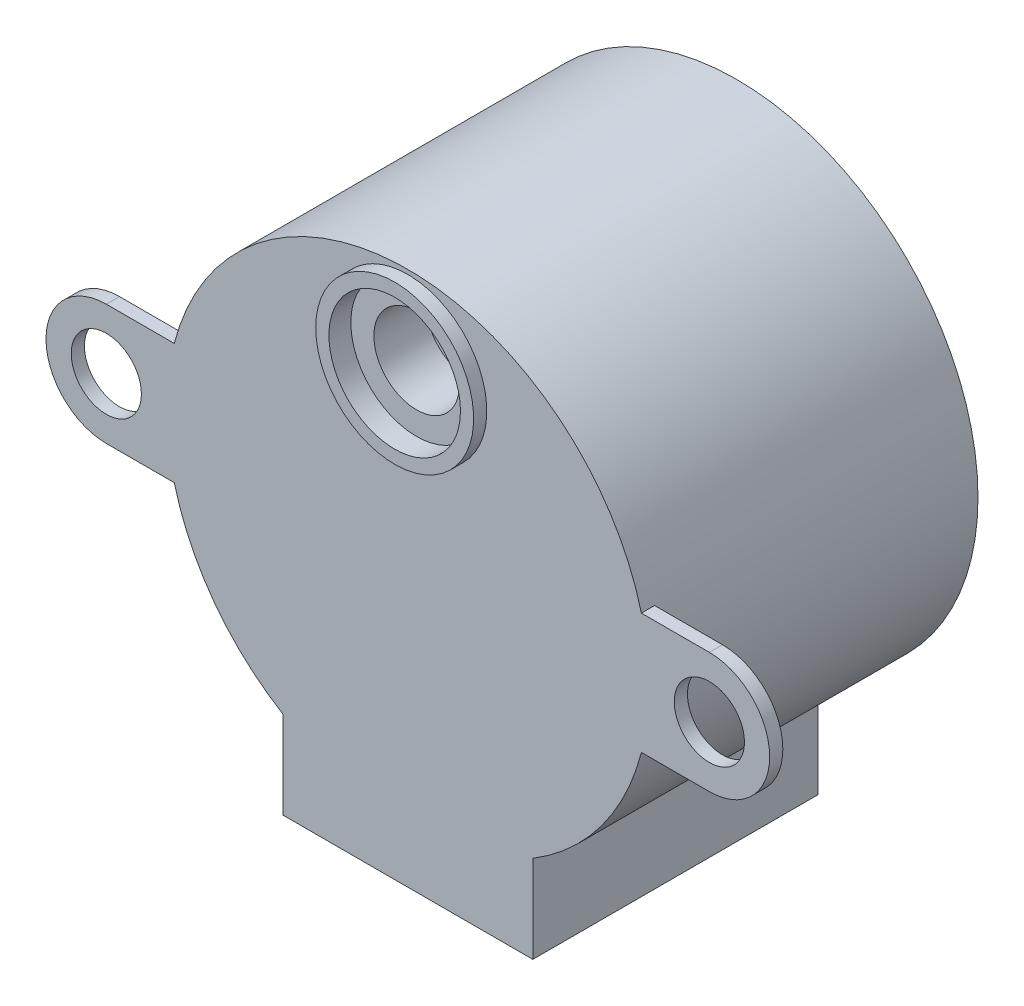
ISO-10303-21;
HEADER;
FILE_DESCRIPTION(('STEP AP214'),'2;1');
FILE_NAME('part.step','',(''),(''),'','','');
FILE_SCHEMA(('AUTOMOTIVE_DESIGN { 1 0 10303 214 1 1 1 1 }'));
ENDSEC;
DATA;
#1=APPLICATION_CONTEXT('core data for automotive mechanical design processes');
#2=APPLICATION_PROTOCOL_DEFINITION('international standard','automotive_design',2000,#1);
#3=PRODUCT_CONTEXT('',#1,'mechanical');
#4=PRODUCT('Part','Part','',(#3));
#5=PRODUCT_RELATED_PRODUCT_CATEGORY('part','',(#4));
#6=PRODUCT_DEFINITION_FORMATION('','',#4);
#7=PRODUCT_DEFINITION_CONTEXT('part definition',#1,'design');
#8=PRODUCT_DEFINITION('design','',#6,#7);
#9=PRODUCT_DEFINITION_SHAPE('','',#8);
#10=(LENGTH_UNIT() NAMED_UNIT(*) SI_UNIT(.MILLI.,.METRE.));
#11=(NAMED_UNIT(*) PLANE_ANGLE_UNIT() SI_UNIT($,.RADIAN.));
#12=(NAMED_UNIT(*) SI_UNIT($,.STERADIAN.) SOLID_ANGLE_UNIT());
#13=UNCERTAINTY_MEASURE_WITH_UNIT(LENGTH_MEASURE(1.E-05),#10,'distance_accuracy_value','');
#14=(GEOMETRIC_REPRESENTATION_CONTEXT(3) GLOBAL_UNCERTAINTY_ASSIGNED_CONTEXT((#13)) GLOBAL_UNIT_ASSIGNED_CONTEXT((#10,
#11,#12)) REPRESENTATION_CONTEXT('',''));
#15=CARTESIAN_POINT('',(0.,0.,0.));
#16=DIRECTION('',(0.,0.,1.));
#17=DIRECTION('',(1.,0.,0.));
#18=AXIS2_PLACEMENT_3D('',#15,#16,#17);
#19=CARTESIAN_POINT('',(0.,0.,19.05));
#20=DIRECTION('',(0.,0.,-1.));
#21=DIRECTION('',(-1.,0.,0.));
#22=AXIS2_PLACEMENT_3D('',#19,#20,#21);
#23=CYLINDRICAL_SURFACE('',#22,13.97);
#24=CARTESIAN_POINT('',(0.,0.,2.54));
#25=DIRECTION('',(0.,0.,1.));
#26=DIRECTION('',(1.,0.,0.));
#27=AXIS2_PLACEMENT_3D('',#24,#25,#26);
#28=CIRCLE('',#27,13.97);
#29=CARTESIAN_POINT('',(-7.239,-11.9481286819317,2.54));
#30=VERTEX_POINT('',#29);
#31=CARTESIAN_POINT('',(7.239,-11.9481286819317,2.54));
#32=VERTEX_POINT('',#31);
#33=EDGE_CURVE('E11',#30,#32,#28,.T.);
#34=ORIENTED_EDGE('',*,*,#33,.F.);
#35=DIRECTION('',(0.,0.,-1.));
#36=VECTOR('',#35,1.);
#37=CARTESIAN_POINT('',(-7.239,-11.9481286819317,19.05));
#38=LINE('',#37,#36);
#39=CARTESIAN_POINT('',(-7.239,-11.9481286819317,19.05));
#40=VERTEX_POINT('',#39);
#41=EDGE_CURVE('E128',#30,#40,#38,.F.);
#42=ORIENTED_EDGE('',*,*,#41,.T.);
#43=CARTESIAN_POINT('',(0.,0.,19.05));
#44=DIRECTION('',(0.,0.,1.));
#45=DIRECTION('',(1.,0.,0.));
#46=AXIS2_PLACEMENT_3D('',#43,#44,#45);
#47=CIRCLE('',#46,13.97);
#48=CARTESIAN_POINT('',(-13.5263943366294,-3.49250000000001,19.05));
#49=VERTEX_POINT('',#48);
#50=EDGE_CURVE('E223',#49,#40,#47,.T.);
#51=ORIENTED_EDGE('',*,*,#50,.F.);
#52=DIRECTION('',(0.,0.,-1.));
#53=VECTOR('',#52,1.);
#54=CARTESIAN_POINT('',(-13.5263943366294,-3.4925,19.05));
#55=LINE('',#54,#53);
#56=CARTESIAN_POINT('',(-13.5263943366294,-3.49250000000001,18.288));
#57=VERTEX_POINT('',#56);
#58=EDGE_CURVE('E215',#49,#57,#55,.T.);
#59=ORIENTED_EDGE('',*,*,#58,.T.);
#60=CARTESIAN_POINT('',(0.,0.,18.288));
#61=DIRECTION('',(0.,0.,1.));
#62=DIRECTION('',(1.,0.,0.));
#63=AXIS2_PLACEMENT_3D('',#60,#61,#62);
#64=CIRCLE('',#63,13.97);
#65=CARTESIAN_POINT('',(-13.5263943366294,3.4925,18.288));
#66=VERTEX_POINT('',#65);
#67=EDGE_CURVE('E40',#66,#57,#64,.T.);
#68=ORIENTED_EDGE('',*,*,#67,.F.);
#69=DIRECTION('',(0.,0.,-1.));
#70=VECTOR('',#69,1.);
#71=CARTESIAN_POINT('',(-13.5263943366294,3.4925,19.05));
#72=LINE('',#71,#70);
#73=CARTESIAN_POINT('',(-13.5263943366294,3.4925,19.05));
#74=VERTEX_POINT('',#73);
#75=EDGE_CURVE('E200',#66,#74,#72,.F.);
#76=ORIENTED_EDGE('',*,*,#75,.T.);
#77=CARTESIAN_POINT('',(13.5263943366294,3.4925,19.05));
#78=VERTEX_POINT('',#77);
#79=EDGE_CURVE('E219',#78,#74,#47,.T.);
#80=ORIENTED_EDGE('',*,*,#79,.F.);
#81=DIRECTION('',(0.,0.,-1.));
#82=VECTOR('',#81,1.);
#83=CARTESIAN_POINT('',(13.5263943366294,3.4925,19.05));
#84=LINE('',#83,#82);
#85=CARTESIAN_POINT('',(13.5263943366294,3.4925,18.288));
#86=VERTEX_POINT('',#85);
#87=EDGE_CURVE('E209',#78,#86,#84,.T.);
#88=ORIENTED_EDGE('',*,*,#87,.T.);
#89=CARTESIAN_POINT('',(13.5263943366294,-3.4925,18.288));
#90=VERTEX_POINT('',#89);
#91=EDGE_CURVE('E222',#90,#86,#64,.T.);
#92=ORIENTED_EDGE('',*,*,#91,.F.);
#93=DIRECTION('',(0.,0.,-1.));
#94=VECTOR('',#93,1.);
#95=CARTESIAN_POINT('',(13.5263943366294,-3.4925,19.05));
#96=LINE('',#95,#94);
#97=CARTESIAN_POINT('',(13.5263943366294,-3.4925,19.05));
#98=VERTEX_POINT('',#97);
#99=EDGE_CURVE('E212',#90,#98,#96,.F.);
#100=ORIENTED_EDGE('',*,*,#99,.T.);
#101=CARTESIAN_POINT('',(7.239,-11.9481286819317,19.05));
#102=VERTEX_POINT('',#101);
#103=EDGE_CURVE('E224',#102,#98,#47,.T.);
#104=ORIENTED_EDGE('',*,*,#103,.F.);
#105=DIRECTION('',(0.,0.,-1.));
#106=VECTOR('',#105,1.);
#107=CARTESIAN_POINT('',(7.239,-11.9481286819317,19.05));
#108=LINE('',#107,#106);
#109=EDGE_CURVE('E153',#102,#32,#108,.T.);
#110=ORIENTED_EDGE('',*,*,#109,.T.);
#111=EDGE_LOOP('',(#34,#42,#51,#59,#68,#76,#80,#88,#92,#100,#104,#110));
#112=FACE_BOUND('',#111,.T.);
#113=CARTESIAN_POINT('',(0.,0.,0.));
#114=DIRECTION('',(0.,0.,1.));
#115=DIRECTION('',(1.,0.,0.));
#116=AXIS2_PLACEMENT_3D('',#113,#114,#115);
#117=CIRCLE('',#116,13.97);
#118=CARTESIAN_POINT('',(13.97,0.,0.));
#119=VERTEX_POINT('',#118);
#120=EDGE_CURVE('E218',#119,#119,#117,.T.);
#121=ORIENTED_EDGE('',*,*,#120,.T.);
#122=EDGE_LOOP('',(#121));
#123=FACE_BOUND('',#122,.T.);
#124=ADVANCED_FACE('F33',(#112,#123),#23,.T.);
#125=CARTESIAN_POINT('',(0.,0.,19.05));
#126=DIRECTION('',(0.,0.,1.));
#127=DIRECTION('',(1.,0.,0.));
#128=AXIS2_PLACEMENT_3D('',#125,#126,#127);
#129=PLANE('',#128);
#130=ORIENTED_EDGE('',*,*,#50,.T.);
#131=DIRECTION('',(0.,-1.,0.));
#132=VECTOR('',#131,1.);
#133=CARTESIAN_POINT('',(-7.239,-11.8025654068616,19.05));
#134=LINE('',#133,#132);
#135=CARTESIAN_POINT('',(-7.239,-17.018,19.05));
#136=VERTEX_POINT('',#135);
#137=EDGE_CURVE('E148',#40,#136,#134,.T.);
#138=ORIENTED_EDGE('',*,*,#137,.T.);
#139=DIRECTION('',(1.,0.,0.));
#140=VECTOR('',#139,1.);
#141=CARTESIAN_POINT('',(-7.239,-17.018,19.05));
#142=LINE('',#141,#140);
#143=CARTESIAN_POINT('',(7.239,-17.018,19.05));
#144=VERTEX_POINT('',#143);
#145=EDGE_CURVE('E137',#136,#144,#142,.T.);
#146=ORIENTED_EDGE('',*,*,#145,.T.);
#147=DIRECTION('',(0.,1.,0.));
#148=VECTOR('',#147,1.);
#149=CARTESIAN_POINT('',(7.239,-11.8025654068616,19.05));
#150=LINE('',#149,#148);
#151=EDGE_CURVE('E47',#144,#102,#150,.T.);
#152=ORIENTED_EDGE('',*,*,#151,.T.);
#153=ORIENTED_EDGE('',*,*,#103,.T.);
#154=DIRECTION('',(1.,0.,0.));
#155=VECTOR('',#154,1.);
#156=CARTESIAN_POINT('',(17.4625,-3.4925,19.05));
#157=LINE('',#156,#155);
#158=CARTESIAN_POINT('',(17.4625,-3.4925,19.05));
#159=VERTEX_POINT('',#158);
#160=EDGE_CURVE('E195',#98,#159,#157,.T.);
#161=ORIENTED_EDGE('',*,*,#160,.T.);
#162=CARTESIAN_POINT('',(17.4625,0.,19.05));
#163=DIRECTION('',(0.,0.,1.));
#164=DIRECTION('',(1.,0.,0.));
#165=AXIS2_PLACEMENT_3D('',#162,#163,#164);
#166=CIRCLE('',#165,3.4925);
#167=CARTESIAN_POINT('',(17.4625,3.4925,19.05));
#168=VERTEX_POINT('',#167);
#169=EDGE_CURVE('E186',#159,#168,#166,.T.);
#170=ORIENTED_EDGE('',*,*,#169,.T.);
#171=DIRECTION('',(-1.,0.,0.));
#172=VECTOR('',#171,1.);
#173=CARTESIAN_POINT('',(17.4625,3.4925,19.05));
#174=LINE('',#173,#172);
#175=EDGE_CURVE('E191',#168,#78,#174,.T.);
#176=ORIENTED_EDGE('',*,*,#175,.T.);
#177=ORIENTED_EDGE('',*,*,#79,.T.);
#178=CARTESIAN_POINT('',(-17.4625,3.4925,19.05));
#179=VERTEX_POINT('',#178);
#180=EDGE_CURVE('E189',#74,#179,#174,.T.);
#181=ORIENTED_EDGE('',*,*,#180,.T.);
#182=CARTESIAN_POINT('',(-17.4625,0.,19.05));
#183=DIRECTION('',(0.,0.,1.));
#184=DIRECTION('',(1.,0.,0.));
#185=AXIS2_PLACEMENT_3D('',#182,#183,#184);
#186=CIRCLE('',#185,3.4925);
#187=CARTESIAN_POINT('',(-17.4625,-3.49250000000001,19.05));
#188=VERTEX_POINT('',#187);
#189=EDGE_CURVE('E193',#179,#188,#186,.T.);
#190=ORIENTED_EDGE('',*,*,#189,.T.);
#191=EDGE_CURVE('E54',#188,#49,#157,.T.);
#192=ORIENTED_EDGE('',*,*,#191,.T.);
#193=EDGE_LOOP('',(#130,#138,#146,#152,#153,#161,#170,#176,#177,#181,#190,#192));
#194=FACE_BOUND('',#193,.T.);
#195=CARTESIAN_POINT('',(0.,9.144,19.05));
#196=DIRECTION('',(0.,0.,1.));
#197=DIRECTION('',(1.,0.,0.));
#198=AXIS2_PLACEMENT_3D('',#195,#196,#197);
#199=CIRCLE('',#198,4.572);
#200=CARTESIAN_POINT('',(-4.572,9.144,19.05));
#201=VERTEX_POINT('',#200);
#202=EDGE_CURVE('E158',#201,#201,#199,.T.);
#203=ORIENTED_EDGE('',*,*,#202,.F.);
#204=EDGE_LOOP('',(#203));
#205=FACE_BOUND('',#204,.T.);
#206=CARTESIAN_POINT('',(-17.4625,0.,19.05));
#207=DIRECTION('',(0.,0.,1.));
#208=DIRECTION('',(1.,0.,0.));
#209=AXIS2_PLACEMENT_3D('',#206,#207,#208);
#210=CIRCLE('',#209,2.032);
#211=CARTESIAN_POINT('',(-15.4305,0.,19.05));
#212=VERTEX_POINT('',#211);
#213=EDGE_CURVE('E165',#212,#212,#210,.T.);
#214=ORIENTED_EDGE('',*,*,#213,.F.);
#215=EDGE_LOOP('',(#214));
#216=FACE_BOUND('',#215,.T.);
#217=CARTESIAN_POINT('',(17.4625,0.,19.05));
#218=DIRECTION('',(0.,0.,1.));
#219=DIRECTION('',(1.,0.,0.));
#220=AXIS2_PLACEMENT_3D('',#217,#218,#219);
#221=CIRCLE('',#220,2.032);
#222=CARTESIAN_POINT('',(19.4945,0.,19.05));
#223=VERTEX_POINT('',#222);
#224=EDGE_CURVE('E162',#223,#223,#221,.T.);
#225=ORIENTED_EDGE('',*,*,#224,.F.);
#226=EDGE_LOOP('',(#225));
#227=FACE_BOUND('',#226,.T.);
#228=ADVANCED_FACE('F253',(#194,#205,#216,#227),#129,.T.);
#229=CARTESIAN_POINT('',(0.,0.,0.));
#230=DIRECTION('',(0.,0.,1.));
#231=DIRECTION('',(1.,0.,0.));
#232=AXIS2_PLACEMENT_3D('',#229,#230,#231);
#233=PLANE('',#232);
#234=ORIENTED_EDGE('',*,*,#120,.F.);
#235=EDGE_LOOP('',(#234));
#236=FACE_BOUND('',#235,.T.);
#237=ADVANCED_FACE('F258',(#236),#233,.F.);
#238=CARTESIAN_POINT('',(17.4625,0.,18.288));
#239=DIRECTION('',(0.,0.,1.));
#240=DIRECTION('',(1.,0.,0.));
#241=AXIS2_PLACEMENT_3D('',#238,#239,#240);
#242=CYLINDRICAL_SURFACE('',#241,3.4925);
#243=ORIENTED_EDGE('',*,*,#169,.F.);
#244=DIRECTION('',(0.,0.,1.));
#245=VECTOR('',#244,1.);
#246=CARTESIAN_POINT('',(17.4625,-3.4925,18.288));
#247=LINE('',#246,#245);
#248=CARTESIAN_POINT('',(17.4625,-3.4925,18.288));
#249=VERTEX_POINT('',#248);
#250=EDGE_CURVE('E197',#249,#159,#247,.T.);
#251=ORIENTED_EDGE('',*,*,#250,.F.);
#252=CARTESIAN_POINT('',(17.4625,0.,18.288));
#253=DIRECTION('',(0.,0.,1.));
#254=DIRECTION('',(1.,0.,0.));
#255=AXIS2_PLACEMENT_3D('',#252,#253,#254);
#256=CIRCLE('',#255,3.4925);
#257=CARTESIAN_POINT('',(17.4625,3.4925,18.288));
#258=VERTEX_POINT('',#257);
#259=EDGE_CURVE('E171',#249,#258,#256,.T.);
#260=ORIENTED_EDGE('',*,*,#259,.T.);
#261=DIRECTION('',(0.,0.,1.));
#262=VECTOR('',#261,1.);
#263=CARTESIAN_POINT('',(17.4625,3.4925,18.288));
#264=LINE('',#263,#262);
#265=EDGE_CURVE('E185',#258,#168,#264,.T.);
#266=ORIENTED_EDGE('',*,*,#265,.T.);
#267=EDGE_LOOP('',(#243,#251,#260,#266));
#268=FACE_BOUND('',#267,.T.);
#269=ADVANCED_FACE('F264',(#268),#242,.T.);
#270=CARTESIAN_POINT('',(17.4625,0.,18.288));
#271=DIRECTION('',(0.,0.,1.));
#272=DIRECTION('',(1.,0.,0.));
#273=AXIS2_PLACEMENT_3D('',#270,#271,#272);
#274=PLANE('',#273);
#275=CARTESIAN_POINT('',(17.4625,0.,18.288));
#276=DIRECTION('',(0.,0.,1.));
#277=DIRECTION('',(1.,0.,0.));
#278=AXIS2_PLACEMENT_3D('',#275,#276,#277);
#279=CIRCLE('',#278,2.032);
#280=CARTESIAN_POINT('',(19.4945,0.,18.288));
#281=VERTEX_POINT('',#280);
#282=EDGE_CURVE('E190',#281,#281,#279,.T.);
#283=ORIENTED_EDGE('',*,*,#282,.T.);
#284=EDGE_LOOP('',(#283));
#285=FACE_BOUND('',#284,.T.);
#286=DIRECTION('',(1.,0.,0.));
#287=VECTOR('',#286,1.);
#288=CARTESIAN_POINT('',(17.4625,-3.4925,18.288));
#289=LINE('',#288,#287);
#290=EDGE_CURVE('E181',#90,#249,#289,.T.);
#291=ORIENTED_EDGE('',*,*,#290,.F.);
#292=ORIENTED_EDGE('',*,*,#91,.T.);
#293=DIRECTION('',(-1.,0.,0.));
#294=VECTOR('',#293,1.);
#295=CARTESIAN_POINT('',(17.4625,3.4925,18.288));
#296=LINE('',#295,#294);
#297=EDGE_CURVE('E175',#258,#86,#296,.T.);
#298=ORIENTED_EDGE('',*,*,#297,.F.);
#299=ORIENTED_EDGE('',*,*,#259,.F.);
#300=EDGE_LOOP('',(#291,#292,#298,#299));
#301=FACE_BOUND('',#300,.T.);
#302=ADVANCED_FACE('F232',(#285,#301),#274,.F.);
#303=CARTESIAN_POINT('',(17.4625,3.4925,18.288));
#304=DIRECTION('',(0.,1.,0.));
#305=DIRECTION('',(-1.,0.,0.));
#306=AXIS2_PLACEMENT_3D('',#303,#304,#305);
#307=PLANE('',#306);
#308=ORIENTED_EDGE('',*,*,#87,.F.);
#309=ORIENTED_EDGE('',*,*,#175,.F.);
#310=ORIENTED_EDGE('',*,*,#265,.F.);
#311=ORIENTED_EDGE('',*,*,#297,.T.);
#312=EDGE_LOOP('',(#308,#309,#310,#311));
#313=FACE_BOUND('',#312,.T.);
#314=ADVANCED_FACE('F271',(#313),#307,.T.);
#315=CARTESIAN_POINT('',(17.4625,-3.4925,18.288));
#316=DIRECTION('',(0.,-1.,0.));
#317=DIRECTION('',(1.,0.,0.));
#318=AXIS2_PLACEMENT_3D('',#315,#316,#317);
#319=PLANE('',#318);
#320=ORIENTED_EDGE('',*,*,#99,.F.);
#321=ORIENTED_EDGE('',*,*,#290,.T.);
#322=ORIENTED_EDGE('',*,*,#250,.T.);
#323=ORIENTED_EDGE('',*,*,#160,.F.);
#324=EDGE_LOOP('',(#320,#321,#322,#323));
#325=FACE_BOUND('',#324,.T.);
#326=ADVANCED_FACE('F274',(#325),#319,.T.);
#327=CARTESIAN_POINT('',(-17.4625,0.,18.288));
#328=DIRECTION('',(0.,0.,1.));
#329=DIRECTION('',(1.,0.,0.));
#330=AXIS2_PLACEMENT_3D('',#327,#328,#329);
#331=CIRCLE('',#330,2.032);
#332=CARTESIAN_POINT('',(-15.4305,0.,18.288));
#333=VERTEX_POINT('',#332);
#334=EDGE_CURVE('E168',#333,#333,#331,.T.);
#335=ORIENTED_EDGE('',*,*,#334,.T.);
#336=EDGE_LOOP('',(#335));
#337=FACE_BOUND('',#336,.T.);
#338=CARTESIAN_POINT('',(-17.4625,3.4925,18.288));
#339=VERTEX_POINT('',#338);
#340=EDGE_CURVE('E174',#66,#339,#296,.T.);
#341=ORIENTED_EDGE('',*,*,#340,.F.);
#342=ORIENTED_EDGE('',*,*,#67,.T.);
#343=CARTESIAN_POINT('',(-17.4625,-3.49250000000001,18.288));
#344=VERTEX_POINT('',#343);
#345=EDGE_CURVE('E182',#344,#57,#289,.T.);
#346=ORIENTED_EDGE('',*,*,#345,.F.);
#347=CARTESIAN_POINT('',(-17.4625,0.,18.288));
#348=DIRECTION('',(0.,0.,1.));
#349=DIRECTION('',(1.,0.,0.));
#350=AXIS2_PLACEMENT_3D('',#347,#348,#349);
#351=CIRCLE('',#350,3.4925);
#352=EDGE_CURVE('E178',#339,#344,#351,.T.);
#353=ORIENTED_EDGE('',*,*,#352,.F.);
#354=EDGE_LOOP('',(#341,#342,#346,#353));
#355=FACE_BOUND('',#354,.T.);
#356=ADVANCED_FACE('F282',(#337,#355),#274,.F.);
#357=ORIENTED_EDGE('',*,*,#58,.F.);
#358=ORIENTED_EDGE('',*,*,#191,.F.);
#359=DIRECTION('',(0.,0.,1.));
#360=VECTOR('',#359,1.);
#361=CARTESIAN_POINT('',(-17.4625,-3.49250000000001,18.288));
#362=LINE('',#361,#360);
#363=EDGE_CURVE('E201',#344,#188,#362,.T.);
#364=ORIENTED_EDGE('',*,*,#363,.F.);
#365=ORIENTED_EDGE('',*,*,#345,.T.);
#366=EDGE_LOOP('',(#357,#358,#364,#365));
#367=FACE_BOUND('',#366,.T.);
#368=ADVANCED_FACE('F280',(#367),#319,.T.);
#369=ORIENTED_EDGE('',*,*,#75,.F.);
#370=ORIENTED_EDGE('',*,*,#340,.T.);
#371=DIRECTION('',(0.,0.,1.));
#372=VECTOR('',#371,1.);
#373=CARTESIAN_POINT('',(-17.4625,3.4925,18.288));
#374=LINE('',#373,#372);
#375=EDGE_CURVE('E203',#339,#179,#374,.T.);
#376=ORIENTED_EDGE('',*,*,#375,.T.);
#377=ORIENTED_EDGE('',*,*,#180,.F.);
#378=EDGE_LOOP('',(#369,#370,#376,#377));
#379=FACE_BOUND('',#378,.T.);
#380=ADVANCED_FACE('F276',(#379),#307,.T.);
#381=CARTESIAN_POINT('',(-17.4625,0.,18.288));
#382=DIRECTION('',(0.,0.,1.));
#383=DIRECTION('',(1.,0.,0.));
#384=AXIS2_PLACEMENT_3D('',#381,#382,#383);
#385=CYLINDRICAL_SURFACE('',#384,3.4925);
#386=ORIENTED_EDGE('',*,*,#189,.F.);
#387=ORIENTED_EDGE('',*,*,#375,.F.);
#388=ORIENTED_EDGE('',*,*,#352,.T.);
#389=ORIENTED_EDGE('',*,*,#363,.T.);
#390=EDGE_LOOP('',(#386,#387,#388,#389));
#391=FACE_BOUND('',#390,.T.);
#392=ADVANCED_FACE('F248',(#391),#385,.T.);
#393=CARTESIAN_POINT('',(-17.4625,0.,0.));
#394=DIRECTION('',(0.,0.,1.));
#395=DIRECTION('',(1.,0.,0.));
#396=AXIS2_PLACEMENT_3D('',#393,#394,#395);
#397=CYLINDRICAL_SURFACE('',#396,2.032);
#398=CARTESIAN_POINT('',(-15.4305,0.,19.05));
#399=CARTESIAN_POINT('',(-15.4305,0.,19.0420625));
#400=CARTESIAN_POINT('',(-15.4305,0.,19.034125));
#401=CARTESIAN_POINT('',(-15.4305,0.,19.01825));
#402=CARTESIAN_POINT('',(-15.4305,0.,19.0103125));
#403=CARTESIAN_POINT('',(-15.4305,0.,18.9944375));
#404=CARTESIAN_POINT('',(-15.4305,0.,18.9865));
#405=CARTESIAN_POINT('',(-15.4305,0.,18.970625));
#406=CARTESIAN_POINT('',(-15.4305,0.,18.9626875));
#407=CARTESIAN_POINT('',(-15.4305,0.,18.9468125));
#408=CARTESIAN_POINT('',(-15.4305,0.,18.938875));
#409=CARTESIAN_POINT('',(-15.4305,0.,18.923));
#410=CARTESIAN_POINT('',(-15.4305,0.,18.9150625));
#411=CARTESIAN_POINT('',(-15.4305,0.,18.8991875));
#412=CARTESIAN_POINT('',(-15.4305,0.,18.89125));
#413=CARTESIAN_POINT('',(-15.4305,0.,18.875375));
#414=CARTESIAN_POINT('',(-15.4305,0.,18.8674375));
#415=CARTESIAN_POINT('',(-15.4305,0.,18.8515625));
#416=CARTESIAN_POINT('',(-15.4305,0.,18.843625));
#417=CARTESIAN_POINT('',(-15.4305,0.,18.82775));
#418=CARTESIAN_POINT('',(-15.4305,0.,18.8198125));
#419=CARTESIAN_POINT('',(-15.4305,0.,18.8039375));
#420=CARTESIAN_POINT('',(-15.4305,0.,18.796));
#421=CARTESIAN_POINT('',(-15.4305,0.,18.780125));
#422=CARTESIAN_POINT('',(-15.4305,0.,18.7721875));
#423=CARTESIAN_POINT('',(-15.4305,0.,18.7563125));
#424=CARTESIAN_POINT('',(-15.4305,0.,18.748375));
#425=CARTESIAN_POINT('',(-15.4305,0.,18.7325));
#426=CARTESIAN_POINT('',(-15.4305,0.,18.7245625));
#427=CARTESIAN_POINT('',(-15.4305,0.,18.7086875));
#428=CARTESIAN_POINT('',(-15.4305,0.,18.70075));
#429=CARTESIAN_POINT('',(-15.4305,0.,18.684875));
#430=CARTESIAN_POINT('',(-15.4305,0.,18.6769375));
#431=CARTESIAN_POINT('',(-15.4305,0.,18.6610625));
#432=CARTESIAN_POINT('',(-15.4305,0.,18.653125));
#433=CARTESIAN_POINT('',(-15.4305,0.,18.63725));
#434=CARTESIAN_POINT('',(-15.4305,0.,18.6293125));
#435=CARTESIAN_POINT('',(-15.4305,0.,18.6134375));
#436=CARTESIAN_POINT('',(-15.4305,0.,18.6055));
#437=CARTESIAN_POINT('',(-15.4305,0.,18.589625));
#438=CARTESIAN_POINT('',(-15.4305,0.,18.5816875));
#439=CARTESIAN_POINT('',(-15.4305,0.,18.5658125));
#440=CARTESIAN_POINT('',(-15.4305,0.,18.557875));
#441=CARTESIAN_POINT('',(-15.4305,0.,18.542));
#442=CARTESIAN_POINT('',(-15.4305,0.,18.5340625));
#443=CARTESIAN_POINT('',(-15.4305,0.,18.5181875));
#444=CARTESIAN_POINT('',(-15.4305,0.,18.51025));
#445=CARTESIAN_POINT('',(-15.4305,0.,18.494375));
#446=CARTESIAN_POINT('',(-15.4305,0.,18.4864375));
#447=CARTESIAN_POINT('',(-15.4305,0.,18.4705625));
#448=CARTESIAN_POINT('',(-15.4305,0.,18.462625));
#449=CARTESIAN_POINT('',(-15.4305,0.,18.44675));
#450=CARTESIAN_POINT('',(-15.4305,0.,18.4388125));
#451=CARTESIAN_POINT('',(-15.4305,0.,18.4229375));
#452=CARTESIAN_POINT('',(-15.4305,0.,18.415));
#453=CARTESIAN_POINT('',(-15.4305,0.,18.399125));
#454=CARTESIAN_POINT('',(-15.4305,0.,18.3911875));
#455=CARTESIAN_POINT('',(-15.4305,0.,18.3753125));
#456=CARTESIAN_POINT('',(-15.4305,0.,18.367375));
#457=CARTESIAN_POINT('',(-15.4305,0.,18.3515));
#458=CARTESIAN_POINT('',(-15.4305,0.,18.3435625));
#459=CARTESIAN_POINT('',(-15.4305,0.,18.3276875));
#460=CARTESIAN_POINT('',(-15.4305,0.,18.31975));
#461=CARTESIAN_POINT('',(-15.4305,0.,18.303875));
#462=CARTESIAN_POINT('',(-15.4305,0.,18.2959375));
#463=CARTESIAN_POINT('',(-15.4305,0.,18.288));
#464=B_SPLINE_CURVE_WITH_KNOTS('',3,(#398,#399,#400,#401,#402,#403,#404,#405,#406,#407,#408,
#409,#410,#411,#412,#413,#414,#415,#416,#417,#418,#419,#420,#421,#422,#423,#424,#425,#426,#427,
#428,#429,#430,#431,#432,#433,#434,#435,#436,#437,#438,#439,#440,#441,#442,#443,#444,#445,#446,
#447,#448,#449,#450,#451,#452,#453,#454,#455,#456,#457,#458,#459,#460,#461,#462,#463),
.UNSPECIFIED.,.F.,.F.,(4,2,2,2,2,2,2,2,2,2,2,2,2,2,2,2,2,2,2,2,2,2,2,2,2,2,2,2,2,2,2,2,4),(0.,
0.0238125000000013,0.0476249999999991,0.0714375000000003,0.0952499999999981,0.119062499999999,
0.142875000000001,0.166687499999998,0.1905,0.214312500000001,0.238124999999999,0.2619375,
0.285750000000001,0.309562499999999,0.333375,0.357187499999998,0.380999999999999,
0.404812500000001,0.428624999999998,0.4524375,0.476249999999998,0.500062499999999,0.523875,
0.547687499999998,0.571499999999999,0.5953125,0.619124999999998,0.642937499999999,
0.666750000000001,0.690562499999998,0.714375,0.738187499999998,0.761999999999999),.UNSPECIFIED.);
#465=EDGE_CURVE('BSEAM238',#212,#333,#464,.T.);
#466=ORIENTED_EDGE('',*,*,#213,.T.);
#467=ORIENTED_EDGE('',*,*,#334,.F.);
#468=ORIENTED_EDGE('',*,*,#465,.T.);
#469=ORIENTED_EDGE('',*,*,#465,.F.);
#470=EDGE_LOOP('',(#466,#468,#467,#469));
#471=FACE_BOUND('',#470,.T.);
#472=ADVANCED_FACE('F238',(#471),#397,.F.);
#473=CARTESIAN_POINT('',(17.4625,0.,0.));
#474=DIRECTION('',(0.,0.,1.));
#475=DIRECTION('',(1.,0.,0.));
#476=AXIS2_PLACEMENT_3D('',#473,#474,#475);
#477=CYLINDRICAL_SURFACE('',#476,2.032);
#478=CARTESIAN_POINT('',(19.4945,0.,19.05));
#479=CARTESIAN_POINT('',(19.4945,0.,19.0420625));
#480=CARTESIAN_POINT('',(19.4945,0.,19.034125));
#481=CARTESIAN_POINT('',(19.4945,0.,19.01825));
#482=CARTESIAN_POINT('',(19.4945,0.,19.0103125));
#483=CARTESIAN_POINT('',(19.4945,0.,18.9944375));
#484=CARTESIAN_POINT('',(19.4945,0.,18.9865));
#485=CARTESIAN_POINT('',(19.4945,0.,18.970625));
#486=CARTESIAN_POINT('',(19.4945,0.,18.9626875));
#487=CARTESIAN_POINT('',(19.4945,0.,18.9468125));
#488=CARTESIAN_POINT('',(19.4945,0.,18.938875));
#489=CARTESIAN_POINT('',(19.4945,0.,18.923));
#490=CARTESIAN_POINT('',(19.4945,0.,18.9150625));
#491=CARTESIAN_POINT('',(19.4945,0.,18.8991875));
#492=CARTESIAN_POINT('',(19.4945,0.,18.89125));
#493=CARTESIAN_POINT('',(19.4945,0.,18.875375));
#494=CARTESIAN_POINT('',(19.4945,0.,18.8674375));
#495=CARTESIAN_POINT('',(19.4945,0.,18.8515625));
#496=CARTESIAN_POINT('',(19.4945,0.,18.843625));
#497=CARTESIAN_POINT('',(19.4945,0.,18.82775));
#498=CARTESIAN_POINT('',(19.4945,0.,18.8198125));
#499=CARTESIAN_POINT('',(19.4945,0.,18.8039375));
#500=CARTESIAN_POINT('',(19.4945,0.,18.796));
#501=CARTESIAN_POINT('',(19.4945,0.,18.780125));
#502=CARTESIAN_POINT('',(19.4945,0.,18.7721875));
#503=CARTESIAN_POINT('',(19.4945,0.,18.7563125));
#504=CARTESIAN_POINT('',(19.4945,0.,18.748375));
#505=CARTESIAN_POINT('',(19.4945,0.,18.7325));
#506=CARTESIAN_POINT('',(19.4945,0.,18.7245625));
#507=CARTESIAN_POINT('',(19.4945,0.,18.7086875));
#508=CARTESIAN_POINT('',(19.4945,0.,18.70075));
#509=CARTESIAN_POINT('',(19.4945,0.,18.684875));
#510=CARTESIAN_POINT('',(19.4945,0.,18.6769375));
#511=CARTESIAN_POINT('',(19.4945,0.,18.6610625));
#512=CARTESIAN_POINT('',(19.4945,0.,18.653125));
#513=CARTESIAN_POINT('',(19.4945,0.,18.63725));
#514=CARTESIAN_POINT('',(19.4945,0.,18.6293125));
#515=CARTESIAN_POINT('',(19.4945,0.,18.6134375));
#516=CARTESIAN_POINT('',(19.4945,0.,18.6055));
#517=CARTESIAN_POINT('',(19.4945,0.,18.589625));
#518=CARTESIAN_POINT('',(19.4945,0.,18.5816875));
#519=CARTESIAN_POINT('',(19.4945,0.,18.5658125));
#520=CARTESIAN_POINT('',(19.4945,0.,18.557875));
#521=CARTESIAN_POINT('',(19.4945,0.,18.542));
#522=CARTESIAN_POINT('',(19.4945,0.,18.5340625));
#523=CARTESIAN_POINT('',(19.4945,0.,18.5181875));
#524=CARTESIAN_POINT('',(19.4945,0.,18.51025));
#525=CARTESIAN_POINT('',(19.4945,0.,18.494375));
#526=CARTESIAN_POINT('',(19.4945,0.,18.4864375));
#527=CARTESIAN_POINT('',(19.4945,0.,18.4705625));
#528=CARTESIAN_POINT('',(19.4945,0.,18.462625));
#529=CARTESIAN_POINT('',(19.4945,0.,18.44675));
#530=CARTESIAN_POINT('',(19.4945,0.,18.4388125));
#531=CARTESIAN_POINT('',(19.4945,0.,18.4229375));
#532=CARTESIAN_POINT('',(19.4945,0.,18.415));
#533=CARTESIAN_POINT('',(19.4945,0.,18.399125));
#534=CARTESIAN_POINT('',(19.4945,0.,18.3911875));
#535=CARTESIAN_POINT('',(19.4945,0.,18.3753125));
#536=CARTESIAN_POINT('',(19.4945,0.,18.367375));
#537=CARTESIAN_POINT('',(19.4945,0.,18.3515));
#538=CARTESIAN_POINT('',(19.4945,0.,18.3435625));
#539=CARTESIAN_POINT('',(19.4945,0.,18.3276875));
#540=CARTESIAN_POINT('',(19.4945,0.,18.31975));
#541=CARTESIAN_POINT('',(19.4945,0.,18.303875));
#542=CARTESIAN_POINT('',(19.4945,0.,18.2959375));
#543=CARTESIAN_POINT('',(19.4945,0.,18.288));
#544=B_SPLINE_CURVE_WITH_KNOTS('',3,(#478,#479,#480,#481,#482,#483,#484,#485,#486,#487,#488,
#489,#490,#491,#492,#493,#494,#495,#496,#497,#498,#499,#500,#501,#502,#503,#504,#505,#506,#507,
#508,#509,#510,#511,#512,#513,#514,#515,#516,#517,#518,#519,#520,#521,#522,#523,#524,#525,#526,
#527,#528,#529,#530,#531,#532,#533,#534,#535,#536,#537,#538,#539,#540,#541,#542,#543),
.UNSPECIFIED.,.F.,.F.,(4,2,2,2,2,2,2,2,2,2,2,2,2,2,2,2,2,2,2,2,2,2,2,2,2,2,2,2,2,2,2,2,4),(0.,
0.0238125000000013,0.0476249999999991,0.0714375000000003,0.0952499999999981,0.119062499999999,
0.142875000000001,0.166687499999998,0.1905,0.214312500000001,0.238124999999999,0.2619375,
0.285750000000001,0.309562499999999,0.333375,0.357187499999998,0.380999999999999,
0.404812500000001,0.428624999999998,0.4524375,0.476249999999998,0.500062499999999,0.523875,
0.547687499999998,0.571499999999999,0.5953125,0.619124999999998,0.642937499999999,
0.666750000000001,0.690562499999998,0.714375,0.738187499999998,0.761999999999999),.UNSPECIFIED.);
#545=EDGE_CURVE('BSEAM235',#223,#281,#544,.T.);
#546=ORIENTED_EDGE('',*,*,#224,.T.);
#547=ORIENTED_EDGE('',*,*,#282,.F.);
#548=ORIENTED_EDGE('',*,*,#545,.T.);
#549=ORIENTED_EDGE('',*,*,#545,.F.);
#550=EDGE_LOOP('',(#546,#548,#547,#549));
#551=FACE_BOUND('',#550,.T.);
#552=ADVANCED_FACE('F235',(#551),#477,.F.);
#553=CARTESIAN_POINT('',(0.,9.144,19.812));
#554=DIRECTION('',(0.,0.,-1.));
#555=DIRECTION('',(-1.,0.,0.));
#556=AXIS2_PLACEMENT_3D('',#553,#554,#555);
#557=CYLINDRICAL_SURFACE('',#556,4.572);
#558=CARTESIAN_POINT('',(0.,9.144,19.812));
#559=DIRECTION('',(0.,0.,1.));
#560=DIRECTION('',(1.,0.,0.));
#561=AXIS2_PLACEMENT_3D('',#558,#559,#560);
#562=CIRCLE('',#561,4.572);
#563=CARTESIAN_POINT('',(-4.572,9.144,19.812));
#564=VERTEX_POINT('',#563);
#565=EDGE_CURVE('E159',#564,#564,#562,.T.);
#566=CARTESIAN_POINT('',(-4.572,9.144,19.812));
#567=CARTESIAN_POINT('',(-4.572,9.144,19.8040625));
#568=CARTESIAN_POINT('',(-4.572,9.144,19.796125));
#569=CARTESIAN_POINT('',(-4.572,9.144,19.78025));
#570=CARTESIAN_POINT('',(-4.572,9.144,19.7723125));
#571=CARTESIAN_POINT('',(-4.572,9.144,19.7564375));
#572=CARTESIAN_POINT('',(-4.572,9.144,19.7485));
#573=CARTESIAN_POINT('',(-4.572,9.144,19.732625));
#574=CARTESIAN_POINT('',(-4.572,9.144,19.7246875));
#575=CARTESIAN_POINT('',(-4.572,9.144,19.7088125));
#576=CARTESIAN_POINT('',(-4.572,9.144,19.700875));
#577=CARTESIAN_POINT('',(-4.572,9.144,19.685));
#578=CARTESIAN_POINT('',(-4.572,9.144,19.6770625));
#579=CARTESIAN_POINT('',(-4.572,9.144,19.6611875));
#580=CARTESIAN_POINT('',(-4.572,9.144,19.65325));
#581=CARTESIAN_POINT('',(-4.572,9.144,19.637375));
#582=CARTESIAN_POINT('',(-4.572,9.144,19.6294375));
#583=CARTESIAN_POINT('',(-4.572,9.144,19.6135625));
#584=CARTESIAN_POINT('',(-4.572,9.144,19.605625));
#585=CARTESIAN_POINT('',(-4.572,9.144,19.58975));
#586=CARTESIAN_POINT('',(-4.572,9.144,19.5818125));
#587=CARTESIAN_POINT('',(-4.572,9.144,19.5659375));
#588=CARTESIAN_POINT('',(-4.572,9.144,19.558));
#589=CARTESIAN_POINT('',(-4.572,9.144,19.542125));
#590=CARTESIAN_POINT('',(-4.572,9.144,19.5341875));
#591=CARTESIAN_POINT('',(-4.572,9.144,19.5183125));
#592=CARTESIAN_POINT('',(-4.572,9.144,19.510375));
#593=CARTESIAN_POINT('',(-4.572,9.144,19.4945));
#594=CARTESIAN_POINT('',(-4.572,9.144,19.4865625));
#595=CARTESIAN_POINT('',(-4.572,9.144,19.4706875));
#596=CARTESIAN_POINT('',(-4.572,9.144,19.46275));
#597=CARTESIAN_POINT('',(-4.572,9.144,19.446875));
#598=CARTESIAN_POINT('',(-4.572,9.144,19.4389375));
#599=CARTESIAN_POINT('',(-4.572,9.144,19.4230625));
#600=CARTESIAN_POINT('',(-4.572,9.144,19.415125));
#601=CARTESIAN_POINT('',(-4.572,9.144,19.39925));
#602=CARTESIAN_POINT('',(-4.572,9.144,19.3913125));
#603=CARTESIAN_POINT('',(-4.572,9.144,19.3754375));
#604=CARTESIAN_POINT('',(-4.572,9.144,19.3675));
#605=CARTESIAN_POINT('',(-4.572,9.144,19.351625));
#606=CARTESIAN_POINT('',(-4.572,9.144,19.3436875));
#607=CARTESIAN_POINT('',(-4.572,9.144,19.3278125));
#608=CARTESIAN_POINT('',(-4.572,9.144,19.319875));
#609=CARTESIAN_POINT('',(-4.572,9.144,19.304));
#610=CARTESIAN_POINT('',(-4.572,9.144,19.2960625));
#611=CARTESIAN_POINT('',(-4.572,9.144,19.2801875));
#612=CARTESIAN_POINT('',(-4.572,9.144,19.27225));
#613=CARTESIAN_POINT('',(-4.572,9.144,19.256375));
#614=CARTESIAN_POINT('',(-4.572,9.144,19.2484375));
#615=CARTESIAN_POINT('',(-4.572,9.144,19.2325625));
#616=CARTESIAN_POINT('',(-4.572,9.144,19.224625));
#617=CARTESIAN_POINT('',(-4.572,9.144,19.20875));
#618=CARTESIAN_POINT('',(-4.572,9.144,19.2008125));
#619=CARTESIAN_POINT('',(-4.572,9.144,19.1849375));
#620=CARTESIAN_POINT('',(-4.572,9.144,19.177));
#621=CARTESIAN_POINT('',(-4.572,9.144,19.161125));
#622=CARTESIAN_POINT('',(-4.572,9.144,19.1531875));
#623=CARTESIAN_POINT('',(-4.572,9.144,19.1373125));
#624=CARTESIAN_POINT('',(-4.572,9.144,19.129375));
#625=CARTESIAN_POINT('',(-4.572,9.144,19.1135));
#626=CARTESIAN_POINT('',(-4.572,9.144,19.1055625));
#627=CARTESIAN_POINT('',(-4.572,9.144,19.0896875));
#628=CARTESIAN_POINT('',(-4.572,9.144,19.08175));
#629=CARTESIAN_POINT('',(-4.572,9.144,19.065875));
#630=CARTESIAN_POINT('',(-4.572,9.144,19.0579375));
#631=CARTESIAN_POINT('',(-4.572,9.144,19.05));
#632=B_SPLINE_CURVE_WITH_KNOTS('',3,(#566,#567,#568,#569,#570,#571,#572,#573,#574,#575,#576,
#577,#578,#579,#580,#581,#582,#583,#584,#585,#586,#587,#588,#589,#590,#591,#592,#593,#594,#595,
#596,#597,#598,#599,#600,#601,#602,#603,#604,#605,#606,#607,#608,#609,#610,#611,#612,#613,#614,
#615,#616,#617,#618,#619,#620,#621,#622,#623,#624,#625,#626,#627,#628,#629,#630,#631),
.UNSPECIFIED.,.F.,.F.,(4,2,2,2,2,2,2,2,2,2,2,2,2,2,2,2,2,2,2,2,2,2,2,2,2,2,2,2,2,2,2,2,4),(0.,
0.0238125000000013,0.0476250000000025,0.0714375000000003,0.0952500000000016,0.119062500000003,
0.142875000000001,0.166687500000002,0.1905,0.214312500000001,0.238125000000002,0.2619375,
0.285750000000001,0.309562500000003,0.333375,0.357187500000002,0.380999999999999,
0.404812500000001,0.428625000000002,0.4524375,0.476250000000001,0.500062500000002,0.523875,
0.547687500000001,0.571499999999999,0.5953125,0.619125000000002,0.642937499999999,
0.666750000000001,0.690562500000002,0.714375,0.738187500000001,0.761999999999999),.UNSPECIFIED.);
#633=EDGE_CURVE('BSEAM237',#564,#201,#632,.T.);
#634=ORIENTED_EDGE('',*,*,#565,.F.);
#635=ORIENTED_EDGE('',*,*,#202,.T.);
#636=ORIENTED_EDGE('',*,*,#633,.T.);
#637=ORIENTED_EDGE('',*,*,#633,.F.);
#638=EDGE_LOOP('',(#634,#636,#635,#637));
#639=FACE_BOUND('',#638,.T.);
#640=ADVANCED_FACE('F237',(#639),#557,.T.);
#641=CARTESIAN_POINT('',(0.,9.144,19.812));
#642=DIRECTION('',(0.,0.,1.));
#643=DIRECTION('',(1.,0.,0.));
#644=AXIS2_PLACEMENT_3D('',#641,#642,#643);
#645=PLANE('',#644);
#646=CARTESIAN_POINT('',(0.,9.144,19.812));
#647=DIRECTION('',(0.,0.,1.));
#648=DIRECTION('',(1.,0.,0.));
#649=AXIS2_PLACEMENT_3D('',#646,#647,#648);
#650=CIRCLE('',#649,3.81);
#651=CARTESIAN_POINT('',(3.81,9.144,19.812));
#652=VERTEX_POINT('',#651);
#653=EDGE_CURVE('E335',#652,#652,#650,.T.);
#654=ORIENTED_EDGE('',*,*,#653,.F.);
#655=EDGE_LOOP('',(#654));
#656=FACE_BOUND('',#655,.T.);
#657=ORIENTED_EDGE('',*,*,#565,.T.);
#658=EDGE_LOOP('',(#657));
#659=FACE_BOUND('',#658,.T.);
#660=ADVANCED_FACE('F245',(#656,#659),#645,.T.);
#661=CARTESIAN_POINT('',(-7.239,-11.8025654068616,2.54));
#662=DIRECTION('',(-1.,0.,0.));
#663=DIRECTION('',(0.,-1.,0.));
#664=AXIS2_PLACEMENT_3D('',#661,#662,#663);
#665=PLANE('',#664);
#666=ORIENTED_EDGE('',*,*,#41,.F.);
#667=DIRECTION('',(0.,-1.,0.));
#668=VECTOR('',#667,1.);
#669=CARTESIAN_POINT('',(-7.239,-11.8025654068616,2.54));
#670=LINE('',#669,#668);
#671=CARTESIAN_POINT('',(-7.239,-17.018,2.54));
#672=VERTEX_POINT('',#671);
#673=EDGE_CURVE('E122',#30,#672,#670,.T.);
#674=ORIENTED_EDGE('',*,*,#673,.T.);
#675=DIRECTION('',(0.,0.,1.));
#676=VECTOR('',#675,1.);
#677=CARTESIAN_POINT('',(-7.239,-17.018,2.54));
#678=LINE('',#677,#676);
#679=EDGE_CURVE('E125',#672,#136,#678,.T.);
#680=ORIENTED_EDGE('',*,*,#679,.T.);
#681=ORIENTED_EDGE('',*,*,#137,.F.);
#682=EDGE_LOOP('',(#666,#674,#680,#681));
#683=FACE_BOUND('',#682,.T.);
#684=ADVANCED_FACE('F124',(#683),#665,.T.);
#685=CARTESIAN_POINT('',(7.239,-11.8025654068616,2.54));
#686=DIRECTION('',(1.,0.,0.));
#687=DIRECTION('',(0.,1.,0.));
#688=AXIS2_PLACEMENT_3D('',#685,#686,#687);
#689=PLANE('',#688);
#690=ORIENTED_EDGE('',*,*,#109,.F.);
#691=ORIENTED_EDGE('',*,*,#151,.F.);
#692=DIRECTION('',(0.,0.,1.));
#693=VECTOR('',#692,1.);
#694=CARTESIAN_POINT('',(7.239,-17.018,2.54));
#695=LINE('',#694,#693);
#696=CARTESIAN_POINT('',(7.239,-17.018,2.54));
#697=VERTEX_POINT('',#696);
#698=EDGE_CURVE('E138',#697,#144,#695,.T.);
#699=ORIENTED_EDGE('',*,*,#698,.F.);
#700=DIRECTION('',(0.,1.,0.));
#701=VECTOR('',#700,1.);
#702=CARTESIAN_POINT('',(7.239,-11.8025654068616,2.54));
#703=LINE('',#702,#701);
#704=EDGE_CURVE('E139',#697,#32,#703,.T.);
#705=ORIENTED_EDGE('',*,*,#704,.T.);
#706=EDGE_LOOP('',(#690,#691,#699,#705));
#707=FACE_BOUND('',#706,.T.);
#708=ADVANCED_FACE('F316',(#707),#689,.T.);
#709=CARTESIAN_POINT('',(-7.239,-17.018,2.54));
#710=DIRECTION('',(0.,-1.,0.));
#711=DIRECTION('',(0.,0.,-1.));
#712=AXIS2_PLACEMENT_3D('',#709,#710,#711);
#713=PLANE('',#712);
#714=ORIENTED_EDGE('',*,*,#145,.F.);
#715=ORIENTED_EDGE('',*,*,#679,.F.);
#716=DIRECTION('',(1.,0.,0.));
#717=VECTOR('',#716,1.);
#718=CARTESIAN_POINT('',(-7.239,-17.018,2.54));
#719=LINE('',#718,#717);
#720=EDGE_CURVE('E132',#672,#697,#719,.T.);
#721=ORIENTED_EDGE('',*,*,#720,.T.);
#722=ORIENTED_EDGE('',*,*,#698,.T.);
#723=EDGE_LOOP('',(#714,#715,#721,#722));
#724=FACE_BOUND('',#723,.T.);
#725=ADVANCED_FACE('F136',(#724),#713,.T.);
#726=CARTESIAN_POINT('',(0.,0.,2.54));
#727=DIRECTION('',(0.,0.,1.));
#728=DIRECTION('',(1.,0.,0.));
#729=AXIS2_PLACEMENT_3D('',#726,#727,#728);
#730=PLANE('',#729);
#731=ORIENTED_EDGE('',*,*,#673,.F.);
#732=ORIENTED_EDGE('',*,*,#33,.T.);
#733=ORIENTED_EDGE('',*,*,#704,.F.);
#734=ORIENTED_EDGE('',*,*,#720,.F.);
#735=EDGE_LOOP('',(#731,#732,#733,#734));
#736=FACE_BOUND('',#735,.T.);
#737=ADVANCED_FACE('F142',(#736),#730,.F.);
#738=CARTESIAN_POINT('',(0.,9.144,18.542));
#739=DIRECTION('',(0.,0.,1.));
#740=DIRECTION('',(1.,0.,0.));
#741=AXIS2_PLACEMENT_3D('',#738,#739,#740);
#742=CYLINDRICAL_SURFACE('',#741,3.81);
#743=CARTESIAN_POINT('',(0.,9.144,18.542));
#744=DIRECTION('',(0.,0.,1.));
#745=DIRECTION('',(1.,0.,0.));
#746=AXIS2_PLACEMENT_3D('',#743,#744,#745);
#747=CIRCLE('',#746,3.81);
#748=CARTESIAN_POINT('',(3.81,9.144,18.542));
#749=VERTEX_POINT('',#748);
#750=EDGE_CURVE('E150',#749,#749,#747,.T.);
#751=ORIENTED_EDGE('',*,*,#750,.F.);
#752=EDGE_LOOP('',(#751));
#753=FACE_BOUND('',#752,.T.);
#754=ORIENTED_EDGE('',*,*,#653,.T.);
#755=EDGE_LOOP('',(#754));
#756=FACE_BOUND('',#755,.T.);
#757=ADVANCED_FACE('F360',(#753,#756),#742,.F.);
#758=CARTESIAN_POINT('',(0.,9.144,18.542));
#759=DIRECTION('',(0.,0.,1.));
#760=DIRECTION('',(1.,0.,0.));
#761=AXIS2_PLACEMENT_3D('',#758,#759,#760);
#762=PLANE('',#761);
#763=CARTESIAN_POINT('',(0.,9.144,18.542));
#764=DIRECTION('',(0.,0.,1.));
#765=DIRECTION('',(1.,0.,0.));
#766=AXIS2_PLACEMENT_3D('',#763,#764,#765);
#767=CIRCLE('',#766,2.4765);
#768=CARTESIAN_POINT('',(2.4765,9.144,18.542));
#769=VERTEX_POINT('',#768);
#770=EDGE_CURVE('E349',#769,#769,#767,.T.);
#771=ORIENTED_EDGE('',*,*,#770,.F.);
#772=EDGE_LOOP('',(#771));
#773=FACE_BOUND('',#772,.T.);
#774=ORIENTED_EDGE('',*,*,#750,.T.);
#775=EDGE_LOOP('',(#774));
#776=FACE_BOUND('',#775,.T.);
#777=ADVANCED_FACE('F357',(#773,#776),#762,.T.);
#778=CARTESIAN_POINT('',(0.,9.144,15.494));
#779=DIRECTION('',(0.,0.,1.));
#780=DIRECTION('',(1.,0.,0.));
#781=AXIS2_PLACEMENT_3D('',#778,#779,#780);
#782=CYLINDRICAL_SURFACE('',#781,2.4765);
#783=CARTESIAN_POINT('',(0.,9.144,15.494));
#784=DIRECTION('',(0.,0.,1.));
#785=DIRECTION('',(1.,0.,0.));
#786=AXIS2_PLACEMENT_3D('',#783,#784,#785);
#787=CIRCLE('',#786,2.4765);
#788=CARTESIAN_POINT('',(2.4765,9.144,15.494));
#789=VERTEX_POINT('',#788);
#790=EDGE_CURVE('E345',#789,#789,#787,.T.);
#791=CARTESIAN_POINT('',(2.4765,9.144,15.494));
#792=CARTESIAN_POINT('',(2.4765,9.144,15.52575));
#793=CARTESIAN_POINT('',(2.4765,9.144,15.5575));
#794=CARTESIAN_POINT('',(2.4765,9.144,15.621));
#795=CARTESIAN_POINT('',(2.4765,9.144,15.65275));
#796=CARTESIAN_POINT('',(2.4765,9.144,15.71625));
#797=CARTESIAN_POINT('',(2.4765,9.144,15.748));
#798=CARTESIAN_POINT('',(2.4765,9.144,15.8115));
#799=CARTESIAN_POINT('',(2.4765,9.144,15.84325));
#800=CARTESIAN_POINT('',(2.4765,9.144,15.90675));
#801=CARTESIAN_POINT('',(2.4765,9.144,15.9385));
#802=CARTESIAN_POINT('',(2.4765,9.144,16.002));
#803=CARTESIAN_POINT('',(2.4765,9.144,16.03375));
#804=CARTESIAN_POINT('',(2.4765,9.144,16.09725));
#805=CARTESIAN_POINT('',(2.4765,9.144,16.129));
#806=CARTESIAN_POINT('',(2.4765,9.144,16.1925));
#807=CARTESIAN_POINT('',(2.4765,9.144,16.22425));
#808=CARTESIAN_POINT('',(2.4765,9.144,16.28775));
#809=CARTESIAN_POINT('',(2.4765,9.144,16.3195));
#810=CARTESIAN_POINT('',(2.4765,9.144,16.383));
#811=CARTESIAN_POINT('',(2.4765,9.144,16.41475));
#812=CARTESIAN_POINT('',(2.4765,9.144,16.47825));
#813=CARTESIAN_POINT('',(2.4765,9.144,16.51));
#814=CARTESIAN_POINT('',(2.4765,9.144,16.5735));
#815=CARTESIAN_POINT('',(2.4765,9.144,16.60525));
#816=CARTESIAN_POINT('',(2.4765,9.144,16.66875));
#817=CARTESIAN_POINT('',(2.4765,9.144,16.7005));
#818=CARTESIAN_POINT('',(2.4765,9.144,16.764));
#819=CARTESIAN_POINT('',(2.4765,9.144,16.79575));
#820=CARTESIAN_POINT('',(2.4765,9.144,16.85925));
#821=CARTESIAN_POINT('',(2.4765,9.144,16.891));
#822=CARTESIAN_POINT('',(2.4765,9.144,16.9545));
#823=CARTESIAN_POINT('',(2.4765,9.144,16.98625));
#824=CARTESIAN_POINT('',(2.4765,9.144,17.04975));
#825=CARTESIAN_POINT('',(2.4765,9.144,17.0815));
#826=CARTESIAN_POINT('',(2.4765,9.144,17.145));
#827=CARTESIAN_POINT('',(2.4765,9.144,17.17675));
#828=CARTESIAN_POINT('',(2.4765,9.144,17.24025));
#829=CARTESIAN_POINT('',(2.4765,9.144,17.272));
#830=CARTESIAN_POINT('',(2.4765,9.144,17.3355));
#831=CARTESIAN_POINT('',(2.4765,9.144,17.36725));
#832=CARTESIAN_POINT('',(2.4765,9.144,17.43075));
#833=CARTESIAN_POINT('',(2.4765,9.144,17.4625));
#834=CARTESIAN_POINT('',(2.4765,9.144,17.526));
#835=CARTESIAN_POINT('',(2.4765,9.144,17.55775));
#836=CARTESIAN_POINT('',(2.4765,9.144,17.62125));
#837=CARTESIAN_POINT('',(2.4765,9.144,17.653));
#838=CARTESIAN_POINT('',(2.4765,9.144,17.7165));
#839=CARTESIAN_POINT('',(2.4765,9.144,17.74825));
#840=CARTESIAN_POINT('',(2.4765,9.144,17.81175));
#841=CARTESIAN_POINT('',(2.4765,9.144,17.8435));
#842=CARTESIAN_POINT('',(2.4765,9.144,17.907));
#843=CARTESIAN_POINT('',(2.4765,9.144,17.93875));
#844=CARTESIAN_POINT('',(2.4765,9.144,18.00225));
#845=CARTESIAN_POINT('',(2.4765,9.144,18.034));
#846=CARTESIAN_POINT('',(2.4765,9.144,18.0975));
#847=CARTESIAN_POINT('',(2.4765,9.144,18.12925));
#848=CARTESIAN_POINT('',(2.4765,9.144,18.19275));
#849=CARTESIAN_POINT('',(2.4765,9.144,18.2245));
#850=CARTESIAN_POINT('',(2.4765,9.144,18.288));
#851=CARTESIAN_POINT('',(2.4765,9.144,18.31975));
#852=CARTESIAN_POINT('',(2.4765,9.144,18.38325));
#853=CARTESIAN_POINT('',(2.4765,9.144,18.415));
#854=CARTESIAN_POINT('',(2.4765,9.144,18.4785));
#855=CARTESIAN_POINT('',(2.4765,9.144,18.51025));
#856=CARTESIAN_POINT('',(2.4765,9.144,18.542));
#857=B_SPLINE_CURVE_WITH_KNOTS('',3,(#791,#792,#793,#794,#795,#796,#797,#798,#799,#800,#801,
#802,#803,#804,#805,#806,#807,#808,#809,#810,#811,#812,#813,#814,#815,#816,#817,#818,#819,#820,
#821,#822,#823,#824,#825,#826,#827,#828,#829,#830,#831,#832,#833,#834,#835,#836,#837,#838,#839,
#840,#841,#842,#843,#844,#845,#846,#847,#848,#849,#850,#851,#852,#853,#854,#855,#856),
.UNSPECIFIED.,.F.,.F.,(4,2,2,2,2,2,2,2,2,2,2,2,2,2,2,2,2,2,2,2,2,2,2,2,2,2,2,2,2,2,2,2,4),(0.,
0.0952499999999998,0.190499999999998,0.28575,0.380999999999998,0.476249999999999,
0.571499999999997,0.666749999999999,0.762000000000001,0.857249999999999,0.9525,1.04775,1.143,
1.23825,1.3335,1.42875,1.524,1.61925,1.7145,1.80975,1.905,2.00025,2.0955,2.19075,2.286,2.38125,
2.4765,2.57175,2.667,2.76225,2.8575,2.95275,3.048),.UNSPECIFIED.);
#858=EDGE_CURVE('BSEAM355',#789,#769,#857,.T.);
#859=ORIENTED_EDGE('',*,*,#790,.F.);
#860=ORIENTED_EDGE('',*,*,#770,.T.);
#861=ORIENTED_EDGE('',*,*,#858,.T.);
#862=ORIENTED_EDGE('',*,*,#858,.F.);
#863=EDGE_LOOP('',(#859,#861,#860,#862));
#864=FACE_BOUND('',#863,.T.);
#865=ADVANCED_FACE('F355',(#864),#782,.F.);
#866=CARTESIAN_POINT('',(0.,9.144,15.494));
#867=DIRECTION('',(0.,0.,1.));
#868=DIRECTION('',(1.,0.,0.));
#869=AXIS2_PLACEMENT_3D('',#866,#867,#868);
#870=PLANE('',#869);
#871=ORIENTED_EDGE('',*,*,#790,.T.);
#872=EDGE_LOOP('',(#871));
#873=FACE_BOUND('',#872,.T.);
#874=ADVANCED_FACE('F371',(#873),#870,.T.);
#875=CLOSED_SHELL('',(#124,#228,#237,#269,#302,#314,#326,#356,#368,#380,#392,#472,#552,#640,
#660,#684,#708,#725,#737,#757,#777,#865,#874));
#876=MANIFOLD_SOLID_BREP('B2',#875);
#877=ADVANCED_BREP_SHAPE_REPRESENTATION('',(#18,#876),#14);
#878=SHAPE_DEFINITION_REPRESENTATION(#9,#877);
ENDSEC;
END-ISO-10303-21;
